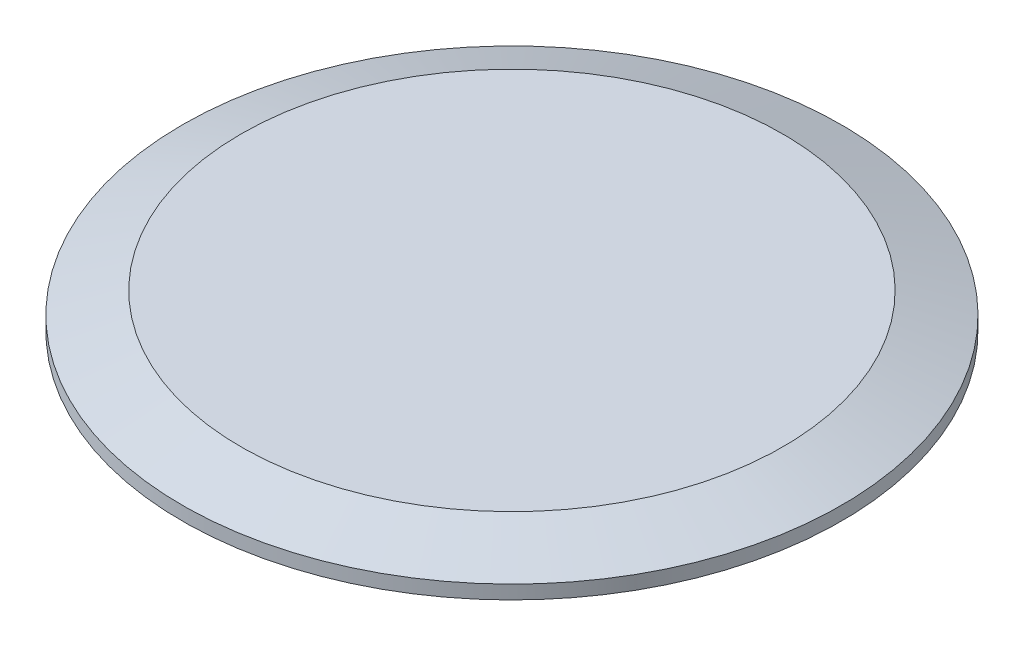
from build123d import *


with BuildPart() as part:
    # Sketch1 → Revolve1 (revolve)
    with BuildSketch(Plane.XY):
        with BuildLine():
            Line((0, 0), (-127.163191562, 0))
            ThreePointArc((-127.163191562, 0), (-127.595388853, 0.129217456), (-127.885733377, 0.474458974))
            ThreePointArc((-127.885733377, 0.474458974), (-128.9812, 1.1938), (-130.076666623, 0.474458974))
            ThreePointArc((-130.076666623, 0.474458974), (-130.367011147, 0.129217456), (-130.799208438, 0))
            Line((-130.799208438, 0), (-134.239, 0))
            Line((-134.239, 0), (-134.239, 5.588))
            Line((-134.239, 5.588), (-110.372213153, 14.2748))
            Line((-110.372213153, 14.2748), (0, 14.2748))
            Line((0, 14.2748), (0, 0))
        make_face()
    revolve(axis=Axis((0, 14.2748, 0), (0, -1, 0)))


solid = part.part
